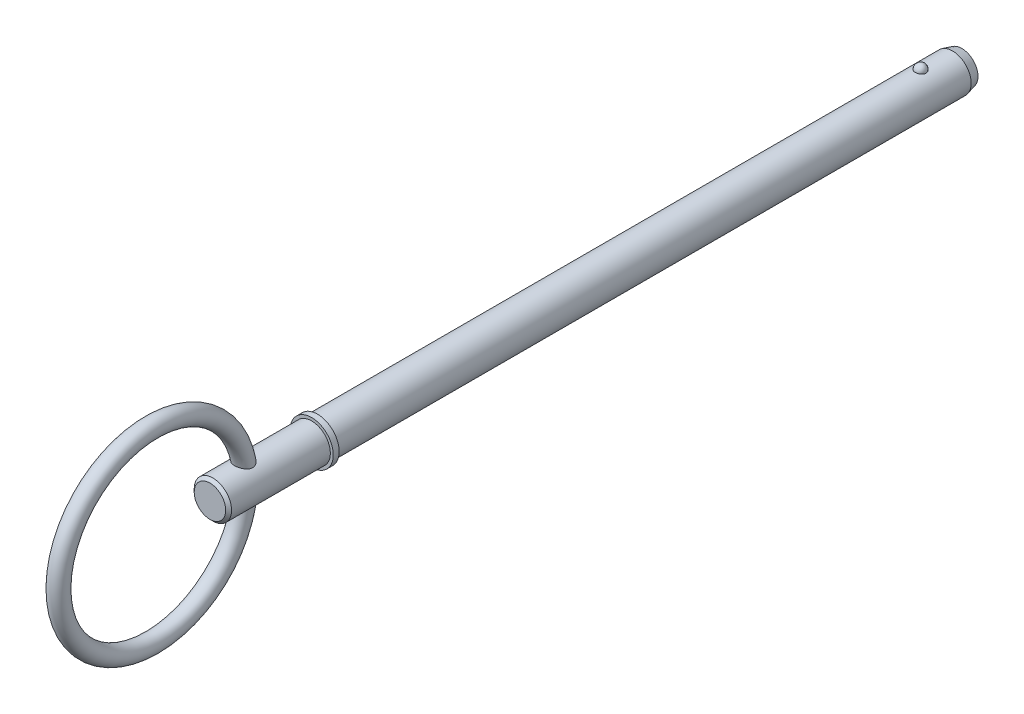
ISO-10303-21;
HEADER;
FILE_DESCRIPTION(('STEP AP214'),'2;1');
FILE_NAME('part.step','',(''),(''),'','','');
FILE_SCHEMA(('AUTOMOTIVE_DESIGN { 1 0 10303 214 1 1 1 1 }'));
ENDSEC;
DATA;
#1=APPLICATION_CONTEXT('core data for automotive mechanical design processes');
#2=APPLICATION_PROTOCOL_DEFINITION('international standard','automotive_design',2000,#1);
#3=PRODUCT_CONTEXT('',#1,'mechanical');
#4=PRODUCT('Part','Part','',(#3));
#5=PRODUCT_RELATED_PRODUCT_CATEGORY('part','',(#4));
#6=PRODUCT_DEFINITION_FORMATION('','',#4);
#7=PRODUCT_DEFINITION_CONTEXT('part definition',#1,'design');
#8=PRODUCT_DEFINITION('design','',#6,#7);
#9=PRODUCT_DEFINITION_SHAPE('','',#8);
#10=(LENGTH_UNIT() NAMED_UNIT(*) SI_UNIT(.MILLI.,.METRE.));
#11=(NAMED_UNIT(*) PLANE_ANGLE_UNIT() SI_UNIT($,.RADIAN.));
#12=(NAMED_UNIT(*) SI_UNIT($,.STERADIAN.) SOLID_ANGLE_UNIT());
#13=UNCERTAINTY_MEASURE_WITH_UNIT(LENGTH_MEASURE(1.E-05),#10,'distance_accuracy_value','');
#14=(GEOMETRIC_REPRESENTATION_CONTEXT(3) GLOBAL_UNCERTAINTY_ASSIGNED_CONTEXT((#13)) GLOBAL_UNIT_ASSIGNED_CONTEXT((#10,
#11,#12)) REPRESENTATION_CONTEXT('',''));
#15=CARTESIAN_POINT('',(0.,0.,0.));
#16=DIRECTION('',(0.,0.,1.));
#17=DIRECTION('',(1.,0.,0.));
#18=AXIS2_PLACEMENT_3D('',#15,#16,#17);
#19=CARTESIAN_POINT('',(0.,0.,101.6));
#20=DIRECTION('',(0.,0.,-1.));
#21=DIRECTION('',(-1.,0.,0.));
#22=AXIS2_PLACEMENT_3D('',#19,#20,#21);
#23=CYLINDRICAL_SURFACE('',#22,3.175);
#24=CARTESIAN_POINT('',(0.90060722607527,3.0445905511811,-0.910000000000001));
#25=CARTESIAN_POINT('',(0.90060646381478,3.04459122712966,-0.859144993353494));
#26=CARTESIAN_POINT('',(0.896466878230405,3.04582460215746,-0.808280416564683));
#27=CARTESIAN_POINT('',(0.88000740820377,3.05062019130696,-0.707994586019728));
#28=CARTESIAN_POINT('',(0.86768478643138,3.05418318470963,-0.658573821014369));
#29=CARTESIAN_POINT('',(0.835170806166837,3.06323316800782,-0.562604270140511));
#30=CARTESIAN_POINT('',(0.81498289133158,3.0687193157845,-0.516054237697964));
#31=CARTESIAN_POINT('',(0.767236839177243,3.08100268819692,-0.427093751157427));
#32=CARTESIAN_POINT('',(0.739678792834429,3.08779989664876,-0.384683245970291));
#33=CARTESIAN_POINT('',(0.677715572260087,3.10198953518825,-0.304951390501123));
#34=CARTESIAN_POINT('',(0.643275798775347,3.10938485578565,-0.267657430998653));
#35=CARTESIAN_POINT('',(0.568522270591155,3.12391647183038,-0.199446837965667));
#36=CARTESIAN_POINT('',(0.528208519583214,3.13105276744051,-0.168530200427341));
#37=CARTESIAN_POINT('',(0.442911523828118,3.14425008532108,-0.114021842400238));
#38=CARTESIAN_POINT('',(0.397942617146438,3.15031426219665,-0.0904084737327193));
#39=CARTESIAN_POINT('',(0.304493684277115,3.16071443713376,-0.0510610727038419));
#40=CARTESIAN_POINT('',(0.256014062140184,3.1650506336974,-0.0353261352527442));
#41=CARTESIAN_POINT('',(0.15789136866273,3.17144549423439,-0.012415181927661));
#42=CARTESIAN_POINT('',(0.108287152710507,3.1735453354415,-0.00508422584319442));
#43=CARTESIAN_POINT('',(0.00850701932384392,3.17538048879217,0.00133254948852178));
#44=CARTESIAN_POINT('',(-0.0416688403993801,3.17511603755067,0.000419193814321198));
#45=CARTESIAN_POINT('',(-0.140377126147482,3.17227395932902,-0.0095484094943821));
#46=CARTESIAN_POINT('',(-0.188922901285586,3.16973088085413,-0.018481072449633));
#47=CARTESIAN_POINT('',(-0.283780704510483,3.16265029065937,-0.044065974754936));
#48=CARTESIAN_POINT('',(-0.330092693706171,3.15811274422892,-0.0607183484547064));
#49=CARTESIAN_POINT('',(-0.419493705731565,3.1474895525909,-0.10140675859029));
#50=CARTESIAN_POINT('',(-0.462561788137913,3.14139480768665,-0.125486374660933));
#51=CARTESIAN_POINT('',(-0.54404237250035,3.12831396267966,-0.180346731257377));
#52=CARTESIAN_POINT('',(-0.582454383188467,3.12132776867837,-0.21112817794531));
#53=CARTESIAN_POINT('',(-0.654371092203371,3.10705591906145,-0.279257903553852));
#54=CARTESIAN_POINT('',(-0.687763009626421,3.09976707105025,-0.316724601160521));
#55=CARTESIAN_POINT('',(-0.747869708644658,3.08581767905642,-0.396782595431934));
#56=CARTESIAN_POINT('',(-0.774583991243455,3.07915718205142,-0.43937427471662));
#57=CARTESIAN_POINT('',(-0.820959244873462,3.06712152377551,-0.529074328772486));
#58=CARTESIAN_POINT('',(-0.840531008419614,3.06176288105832,-0.576231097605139));
#59=CARTESIAN_POINT('',(-0.871672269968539,3.0530437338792,-0.673291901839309));
#60=CARTESIAN_POINT('',(-0.883242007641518,3.04968316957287,-0.723195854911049));
#61=CARTESIAN_POINT('',(-0.898057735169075,3.04535343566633,-0.824104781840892));
#62=CARTESIAN_POINT('',(-0.901339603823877,3.04437395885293,-0.875104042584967));
#63=CARTESIAN_POINT('',(-0.89960137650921,3.04488803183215,-0.976947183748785));
#64=CARTESIAN_POINT('',(-0.894581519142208,3.04638151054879,-1.02779106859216));
#65=CARTESIAN_POINT('',(-0.876414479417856,3.051656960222,-1.12760218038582));
#66=CARTESIAN_POINT('',(-0.863310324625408,3.05542681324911,-1.17657789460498));
#67=CARTESIAN_POINT('',(-0.829334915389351,3.06482253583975,-1.27156757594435));
#68=CARTESIAN_POINT('',(-0.808463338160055,3.07044848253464,-1.31758141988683));
#69=CARTESIAN_POINT('',(-0.75932502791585,3.08296842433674,-1.40563218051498));
#70=CARTESIAN_POINT('',(-0.731017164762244,3.08986940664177,-1.44764515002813));
#71=CARTESIAN_POINT('',(-0.667767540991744,3.10415201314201,-1.52624913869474));
#72=CARTESIAN_POINT('',(-0.632825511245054,3.11153365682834,-1.56283993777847));
#73=CARTESIAN_POINT('',(-0.557049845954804,3.12598962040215,-1.62972906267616));
#74=CARTESIAN_POINT('',(-0.516193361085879,3.13306260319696,-1.66000181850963));
#75=CARTESIAN_POINT('',(-0.429792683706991,3.14607829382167,-1.7132172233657));
#76=CARTESIAN_POINT('',(-0.384248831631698,3.15202108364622,-1.73616040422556));
#77=CARTESIAN_POINT('',(-0.290370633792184,3.16204171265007,-1.77380927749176));
#78=CARTESIAN_POINT('',(-0.242079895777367,3.16614263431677,-1.7886174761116));
#79=CARTESIAN_POINT('',(-0.143579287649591,3.17213528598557,-1.81001390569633));
#80=CARTESIAN_POINT('',(-0.0933696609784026,3.1740272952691,-1.81660317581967));
#81=CARTESIAN_POINT('',(0.00648182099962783,3.17537830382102,-1.82132177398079));
#82=CARTESIAN_POINT('',(0.0561153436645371,3.17488455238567,-1.81961539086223));
#83=CARTESIAN_POINT('',(0.154368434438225,3.1716260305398,-1.80816900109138));
#84=CARTESIAN_POINT('',(0.202988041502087,3.16886134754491,-1.79842930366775));
#85=CARTESIAN_POINT('',(0.29764238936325,3.16137318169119,-1.77125024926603));
#86=CARTESIAN_POINT('',(0.343686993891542,3.15665785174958,-1.75384292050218));
#87=CARTESIAN_POINT('',(0.432167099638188,3.14576631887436,-1.71181408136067));
#88=CARTESIAN_POINT('',(0.474602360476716,3.13959001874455,-1.68719209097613));
#89=CARTESIAN_POINT('',(0.555408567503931,3.1263159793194,-1.63094218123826));
#90=CARTESIAN_POINT('',(0.593703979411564,3.11920512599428,-1.59920888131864));
#91=CARTESIAN_POINT('',(0.664472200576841,3.10490064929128,-1.52981493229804));
#92=CARTESIAN_POINT('',(0.696944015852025,3.09770701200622,-1.49215327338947));
#93=CARTESIAN_POINT('',(0.755798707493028,3.08388169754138,-1.41116434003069));
#94=CARTESIAN_POINT('',(0.782059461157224,3.07726269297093,-1.36774610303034));
#95=CARTESIAN_POINT('',(0.827051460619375,3.06547790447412,-1.27699966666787));
#96=CARTESIAN_POINT('',(0.845785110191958,3.06031165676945,-1.22967272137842));
#97=CARTESIAN_POINT('',(0.873798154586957,3.05242388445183,-1.13728658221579));
#98=CARTESIAN_POINT('',(0.883833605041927,3.04951005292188,-1.09247132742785));
#99=CARTESIAN_POINT('',(0.897238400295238,3.0455931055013,-1.00177329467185));
#100=CARTESIAN_POINT('',(0.900607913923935,3.0445899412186,-0.955890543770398));
#101=CARTESIAN_POINT('',(0.90060722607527,3.0445905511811,-0.910000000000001));
#102=B_SPLINE_CURVE_WITH_KNOTS('',3,(#24,#25,#26,#27,#28,#29,#30,#31,#32,#33,#34,#35,#36,#37,
#38,#39,#40,#41,#42,#43,#44,#45,#46,#47,#48,#49,#50,#51,#52,#53,#54,#55,#56,#57,#58,#59,#60,#61,
#62,#63,#64,#65,#66,#67,#68,#69,#70,#71,#72,#73,#74,#75,#76,#77,#78,#79,#80,#81,#82,#83,#84,#85,
#86,#87,#88,#89,#90,#91,#92,#93,#94,#95,#96,#97,#98,#99,#100,#101),.UNSPECIFIED.,.T.,.F.,(4,2,2,
2,2,2,2,2,2,2,2,2,2,2,2,2,2,2,2,2,2,2,2,2,2,2,2,2,2,2,2,2,2,2,2,2,2,2,4),(0.,0.152400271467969,
0.304851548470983,0.45723615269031,0.609618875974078,0.762787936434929,0.915956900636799,
1.06866739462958,1.22136034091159,1.37119044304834,1.52100555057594,1.66858689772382,
1.81617081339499,1.9646377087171,2.1131202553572,2.26455561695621,2.41600229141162,
2.5692805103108,2.72255413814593,2.87516308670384,3.02776764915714,3.1795669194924,
3.33137249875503,3.48403607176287,3.63670583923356,3.78998198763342,3.94324701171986,
4.09453370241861,4.24580126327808,4.39408543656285,4.54236390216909,4.69002878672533,
4.83770349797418,4.9877312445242,5.13778457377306,5.29058018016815,5.44332695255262,
5.58085340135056,5.71837636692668),.UNSPECIFIED.);
#103=CARTESIAN_POINT('',(0.90060722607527,3.0445905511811,-0.910000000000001));
#104=VERTEX_POINT('',#103);
#105=EDGE_CURVE('E101',#104,#104,#102,.T.);
#106=ORIENTED_EDGE('',*,*,#105,.T.);
#107=EDGE_LOOP('',(#106));
#108=FACE_BOUND('',#107,.T.);
#109=CARTESIAN_POINT('',(0.,0.,-6.33399999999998));
#110=DIRECTION('',(0.,0.,-1.));
#111=DIRECTION('',(-1.,0.,0.));
#112=AXIS2_PLACEMENT_3D('',#109,#110,#111);
#113=CIRCLE('',#112,3.175);
#114=CARTESIAN_POINT('',(-3.175,0.,-6.33399999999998));
#115=VERTEX_POINT('',#114);
#116=EDGE_CURVE('E109',#115,#115,#113,.F.);
#117=ORIENTED_EDGE('',*,*,#116,.T.);
#118=EDGE_LOOP('',(#117));
#119=FACE_BOUND('',#118,.T.);
#120=CARTESIAN_POINT('',(0.,0.,101.6));
#121=DIRECTION('',(0.,0.,1.));
#122=DIRECTION('',(1.,0.,0.));
#123=AXIS2_PLACEMENT_3D('',#120,#121,#122);
#124=CIRCLE('',#123,3.175);
#125=CARTESIAN_POINT('',(3.175,0.,101.6));
#126=VERTEX_POINT('',#125);
#127=EDGE_CURVE('E107',#126,#126,#124,.T.);
#128=ORIENTED_EDGE('',*,*,#127,.F.);
#129=EDGE_LOOP('',(#128));
#130=FACE_BOUND('',#129,.T.);
#131=ADVANCED_FACE('F39',(#108,#119,#130),#23,.T.);
#132=CARTESIAN_POINT('',(0.,0.,-7.92));
#133=DIRECTION('',(0.,0.,-1.));
#134=DIRECTION('',(-1.,0.,0.));
#135=AXIS2_PLACEMENT_3D('',#132,#133,#134);
#136=PLANE('',#135);
#137=CARTESIAN_POINT('',(0.,0.,-7.92));
#138=DIRECTION('',(0.,0.,-1.));
#139=DIRECTION('',(-1.,0.,0.));
#140=AXIS2_PLACEMENT_3D('',#137,#138,#139);
#141=CIRCLE('',#140,2.75003258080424);
#142=CARTESIAN_POINT('',(-2.75003258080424,0.,-7.92));
#143=VERTEX_POINT('',#142);
#144=EDGE_CURVE('E141',#143,#143,#141,.T.);
#145=ORIENTED_EDGE('',*,*,#144,.T.);
#146=EDGE_LOOP('',(#145));
#147=FACE_BOUND('',#146,.T.);
#148=ADVANCED_FACE('F87',(#147),#136,.T.);
#149=CARTESIAN_POINT('',(0.,0.,-7.92));
#150=DIRECTION('',(0.,0.,1.));
#151=DIRECTION('',(1.,0.,0.));
#152=AXIS2_PLACEMENT_3D('',#149,#150,#151);
#153=CONICAL_SURFACE('',#152,2.75003258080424,0.261799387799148);
#154=ORIENTED_EDGE('',*,*,#116,.F.);
#155=EDGE_LOOP('',(#154));
#156=FACE_BOUND('',#155,.T.);
#157=ORIENTED_EDGE('',*,*,#144,.F.);
#158=EDGE_LOOP('',(#157));
#159=FACE_BOUND('',#158,.T.);
#160=ADVANCED_FACE('F93',(#156,#159),#153,.T.);
#161=CARTESIAN_POINT('',(0.,3.175,-0.910000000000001));
#162=DIRECTION('',(0.,1.,0.));
#163=DIRECTION('',(0.,0.,-1.));
#164=AXIS2_PLACEMENT_3D('',#161,#162,#163);
#165=SPHERICAL_SURFACE('',#164,0.91);
#166=ORIENTED_EDGE('',*,*,#105,.F.);
#167=EDGE_LOOP('',(#166));
#168=FACE_BOUND('',#167,.T.);
#169=ADVANCED_FACE('F112',(#168),#165,.T.);
#170=CARTESIAN_POINT('',(0.,0.,101.6));
#171=DIRECTION('',(0.,0.,-1.));
#172=DIRECTION('',(-1.,0.,0.));
#173=AXIS2_PLACEMENT_3D('',#170,#171,#172);
#174=PLANE('',#173);
#175=ORIENTED_EDGE('',*,*,#127,.T.);
#176=EDGE_LOOP('',(#175));
#177=FACE_BOUND('',#176,.T.);
#178=CARTESIAN_POINT('',(0.,0.,101.6));
#179=DIRECTION('',(0.,0.,-1.));
#180=DIRECTION('',(-1.,0.,0.));
#181=AXIS2_PLACEMENT_3D('',#178,#179,#180);
#182=CIRCLE('',#181,3.675);
#183=CARTESIAN_POINT('',(-3.675,0.,101.6));
#184=VERTEX_POINT('',#183);
#185=EDGE_CURVE('E108',#184,#184,#182,.T.);
#186=ORIENTED_EDGE('',*,*,#185,.T.);
#187=EDGE_LOOP('',(#186));
#188=FACE_BOUND('',#187,.T.);
#189=ADVANCED_FACE('F116',(#177,#188),#174,.T.);
#190=CARTESIAN_POINT('',(0.,0.,33.7287874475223));
#191=DIRECTION('',(0.,0.,-1.));
#192=DIRECTION('',(-1.,0.,0.));
#193=AXIS2_PLACEMENT_3D('',#190,#191,#192);
#194=CYLINDRICAL_SURFACE('',#193,3.675);
#195=CARTESIAN_POINT('',(0.,0.,102.6));
#196=DIRECTION('',(0.,0.,-1.));
#197=DIRECTION('',(-1.,0.,0.));
#198=AXIS2_PLACEMENT_3D('',#195,#196,#197);
#199=CIRCLE('',#198,3.675);
#200=CARTESIAN_POINT('',(-3.675,0.,102.6));
#201=VERTEX_POINT('',#200);
#202=EDGE_CURVE('E133',#201,#201,#199,.T.);
#203=ORIENTED_EDGE('',*,*,#202,.T.);
#204=EDGE_LOOP('',(#203));
#205=FACE_BOUND('',#204,.T.);
#206=ORIENTED_EDGE('',*,*,#185,.F.);
#207=EDGE_LOOP('',(#206));
#208=FACE_BOUND('',#207,.T.);
#209=ADVANCED_FACE('F120',(#205,#208),#194,.T.);
#210=CARTESIAN_POINT('',(0.,3.675,102.6));
#211=DIRECTION('',(0.,0.,1.));
#212=DIRECTION('',(1.,0.,0.));
#213=AXIS2_PLACEMENT_3D('',#210,#211,#212);
#214=PLANE('',#213);
#215=CARTESIAN_POINT('',(0.,0.,102.6));
#216=DIRECTION('',(0.,0.,1.));
#217=DIRECTION('',(1.,0.,0.));
#218=AXIS2_PLACEMENT_3D('',#215,#216,#217);
#219=CIRCLE('',#218,3.175);
#220=CARTESIAN_POINT('',(3.175,0.,102.6));
#221=VERTEX_POINT('',#220);
#222=EDGE_CURVE('E111',#221,#221,#219,.T.);
#223=ORIENTED_EDGE('',*,*,#222,.F.);
#224=EDGE_LOOP('',(#223));
#225=FACE_BOUND('',#224,.T.);
#226=ORIENTED_EDGE('',*,*,#202,.F.);
#227=EDGE_LOOP('',(#226));
#228=FACE_BOUND('',#227,.T.);
#229=ADVANCED_FACE('F84',(#225,#228),#214,.T.);
#230=CARTESIAN_POINT('',(0.,0.,119.89));
#231=DIRECTION('',(0.,0.,-1.));
#232=DIRECTION('',(-1.,0.,0.));
#233=AXIS2_PLACEMENT_3D('',#230,#231,#232);
#234=CYLINDRICAL_SURFACE('',#233,3.175);
#235=CARTESIAN_POINT('',(-0.793622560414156,-3.07421343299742,112.894961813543));
#236=CARTESIAN_POINT('',(-0.723928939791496,-3.09220199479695,112.854074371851));
#237=CARTESIAN_POINT('',(-0.650537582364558,-3.10860299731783,112.818657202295));
#238=CARTESIAN_POINT('',(-0.498225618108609,-3.13662262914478,112.75960803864));
#239=CARTESIAN_POINT('',(-0.41929921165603,-3.14823615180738,112.735988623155));
#240=CARTESIAN_POINT('',(-0.258022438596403,-3.16553731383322,112.701178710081));
#241=CARTESIAN_POINT('',(-0.175668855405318,-3.17121924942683,112.690000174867));
#242=CARTESIAN_POINT('',(-0.0100583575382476,-3.17606405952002,112.680453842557));
#243=CARTESIAN_POINT('',(0.0731982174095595,-3.17522930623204,112.682081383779));
#244=CARTESIAN_POINT('',(0.236345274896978,-3.16722178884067,112.697907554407));
#245=CARTESIAN_POINT('',(0.316269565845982,-3.16018772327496,112.711831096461));
#246=CARTESIAN_POINT('',(0.472429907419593,-3.14064183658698,112.751487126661));
#247=CARTESIAN_POINT('',(0.548665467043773,-3.12812928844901,112.777221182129));
#248=CARTESIAN_POINT('',(0.696533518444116,-3.0985857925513,112.840314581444));
#249=CARTESIAN_POINT('',(0.768085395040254,-3.08149328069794,112.877833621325));
#250=CARTESIAN_POINT('',(0.90366694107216,-3.04449595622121,112.963584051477));
#251=CARTESIAN_POINT('',(0.967693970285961,-3.02459016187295,113.011819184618));
#252=CARTESIAN_POINT('',(1.08889306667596,-2.98315111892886,113.120085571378));
#253=CARTESIAN_POINT('',(1.14572430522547,-2.96158491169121,113.18048692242));
#254=CARTESIAN_POINT('',(1.24806454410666,-2.91993487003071,113.310687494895));
#255=CARTESIAN_POINT('',(1.29357550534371,-2.89985077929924,113.380485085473));
#256=CARTESIAN_POINT('',(1.37094214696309,-2.86407549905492,113.52626000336));
#257=CARTESIAN_POINT('',(1.40307792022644,-2.84829687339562,113.602066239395));
#258=CARTESIAN_POINT('',(1.45397574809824,-2.82265933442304,113.758955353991));
#259=CARTESIAN_POINT('',(1.47274938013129,-2.81279529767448,113.840033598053));
#260=CARTESIAN_POINT('',(1.49549698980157,-2.80076108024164,113.997902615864));
#261=CARTESIAN_POINT('',(1.50056337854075,-2.79802369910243,114.074495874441));
#262=CARTESIAN_POINT('',(1.49933665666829,-2.79868066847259,114.227554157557));
#263=CARTESIAN_POINT('',(1.49304097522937,-2.80207640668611,114.304019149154));
#264=CARTESIAN_POINT('',(1.46976618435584,-2.81435249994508,114.455280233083));
#265=CARTESIAN_POINT('',(1.45272287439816,-2.82326580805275,114.53006347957));
#266=CARTESIAN_POINT('',(1.40884990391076,-2.84541139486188,114.676008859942));
#267=CARTESIAN_POINT('',(1.38201642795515,-2.85864535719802,114.747169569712));
#268=CARTESIAN_POINT('',(1.31496449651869,-2.89016475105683,114.894607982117));
#269=CARTESIAN_POINT('',(1.27338339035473,-2.9089013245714,114.970169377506));
#270=CARTESIAN_POINT('',(1.17952729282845,-2.94820796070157,115.11390343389));
#271=CARTESIAN_POINT('',(1.12723913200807,-2.96878026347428,115.182066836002));
#272=CARTESIAN_POINT('',(1.00570728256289,-3.01228109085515,115.317310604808));
#273=CARTESIAN_POINT('',(0.935174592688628,-3.03519170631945,115.383249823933));
#274=CARTESIAN_POINT('',(0.782605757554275,-3.07805054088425,115.501321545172));
#275=CARTESIAN_POINT('',(0.700588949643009,-3.09800362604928,115.553476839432));
#276=CARTESIAN_POINT('',(0.549003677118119,-3.12787153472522,115.629642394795));
#277=CARTESIAN_POINT('',(0.481582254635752,-3.1390487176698,115.657437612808));
#278=CARTESIAN_POINT('',(0.342696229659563,-3.15722518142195,115.702156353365));
#279=CARTESIAN_POINT('',(0.27123564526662,-3.16422853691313,115.719090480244));
#280=CARTESIAN_POINT('',(0.125873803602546,-3.17334230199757,115.741062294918));
#281=CARTESIAN_POINT('',(0.0519637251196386,-3.17543249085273,115.746050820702));
#282=CARTESIAN_POINT('',(-0.0956207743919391,-3.17441743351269,115.743618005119));
#283=CARTESIAN_POINT('',(-0.169295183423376,-3.1713119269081,115.736196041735));
#284=CARTESIAN_POINT('',(-0.309449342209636,-3.16061694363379,115.710337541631));
#285=CARTESIAN_POINT('',(-0.376089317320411,-3.15332372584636,115.692627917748));
#286=CARTESIAN_POINT('',(-0.505583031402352,-3.13517004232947,115.647787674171));
#287=CARTESIAN_POINT('',(-0.568435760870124,-3.12430863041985,115.620654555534));
#288=CARTESIAN_POINT('',(-0.694306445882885,-3.09887452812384,115.555562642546));
#289=CARTESIAN_POINT('',(-0.756907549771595,-3.08406907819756,115.516893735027));
#290=CARTESIAN_POINT('',(-0.875645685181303,-3.05248288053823,115.431345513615));
#291=CARTESIAN_POINT('',(-0.931779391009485,-3.03570112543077,115.384462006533));
#292=CARTESIAN_POINT('',(-1.0463923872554,-2.99832170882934,115.27479262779));
#293=CARTESIAN_POINT('',(-1.10353654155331,-2.97757338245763,115.210660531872));
#294=CARTESIAN_POINT('',(-1.20755858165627,-2.93692907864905,115.074226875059));
#295=CARTESIAN_POINT('',(-1.25442453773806,-2.91703411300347,115.001915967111));
#296=CARTESIAN_POINT('',(-1.34199791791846,-2.87788786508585,114.841279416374));
#297=CARTESIAN_POINT('',(-1.38127718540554,-2.85900475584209,114.752074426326));
#298=CARTESIAN_POINT('',(-1.44406659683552,-2.82781619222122,114.567183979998));
#299=CARTESIAN_POINT('',(-1.46759319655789,-2.81550387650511,114.471505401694));
#300=CARTESIAN_POINT('',(-1.49571801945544,-2.8006591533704,114.284577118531));
#301=CARTESIAN_POINT('',(-1.50169726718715,-2.79741422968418,114.193598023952));
#302=CARTESIAN_POINT('',(-1.49747735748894,-2.79967890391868,114.012156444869));
#303=CARTESIAN_POINT('',(-1.48729863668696,-2.80517744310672,113.921693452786));
#304=CARTESIAN_POINT('',(-1.45348639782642,-2.82281521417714,113.758462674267));
#305=CARTESIAN_POINT('',(-1.43212237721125,-2.83382344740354,113.685088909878));
#306=CARTESIAN_POINT('',(-1.37828411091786,-2.86039426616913,113.543390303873));
#307=CARTESIAN_POINT('',(-1.34580440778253,-2.87595908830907,113.475067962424));
#308=CARTESIAN_POINT('',(-1.27066760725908,-2.90993532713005,113.345033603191));
#309=CARTESIAN_POINT('',(-1.22800357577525,-2.9283486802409,113.283326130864));
#310=CARTESIAN_POINT('',(-1.13363307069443,-2.96615489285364,113.167708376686));
#311=CARTESIAN_POINT('',(-1.08193541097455,-2.98554678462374,113.113790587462));
#312=CARTESIAN_POINT('',(-0.990573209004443,-3.01675653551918,113.03230940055));
#313=CARTESIAN_POINT('',(-0.953209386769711,-3.02880489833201,113.002213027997));
#314=CARTESIAN_POINT('',(-0.875544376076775,-3.0521621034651,112.945747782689));
#315=CARTESIAN_POINT('',(-0.835242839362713,-3.06347085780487,112.919379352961));
#316=CARTESIAN_POINT('',(-0.793622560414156,-3.07421343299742,112.894961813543));
#317=B_SPLINE_CURVE_WITH_KNOTS('',3,(#235,#236,#237,#238,#239,#240,#241,#242,#243,#244,#245,
#246,#247,#248,#249,#250,#251,#252,#253,#254,#255,#256,#257,#258,#259,#260,#261,#262,#263,#264,
#265,#266,#267,#268,#269,#270,#271,#272,#273,#274,#275,#276,#277,#278,#279,#280,#281,#282,#283,
#284,#285,#286,#287,#288,#289,#290,#291,#292,#293,#294,#295,#296,#297,#298,#299,#300,#301,#302,
#303,#304,#305,#306,#307,#308,#309,#310,#311,#312,#313,#314,#315,#316),.UNSPECIFIED.,.T.,.F.,(4,
2,2,2,2,2,2,2,2,2,2,2,2,2,2,2,2,2,2,2,2,2,2,2,2,2,2,2,2,2,2,2,2,2,2,2,2,2,2,2,4),(0.,
0.248167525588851,0.496599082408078,0.745269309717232,0.993849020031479,1.23700449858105,
1.48019225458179,1.72682894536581,1.97355191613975,2.22939388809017,2.48519151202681,
2.73532416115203,2.98523982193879,3.21455414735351,3.44392036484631,3.67466984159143,
3.90550934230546,4.16925064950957,4.43331832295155,4.72951976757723,5.02522832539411,
5.24564983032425,5.46585579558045,5.68696647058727,5.90808822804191,6.11521387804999,
6.32239449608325,6.54672206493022,6.77116447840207,7.03522663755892,7.29959368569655,
7.59590092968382,7.89189815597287,8.16387683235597,8.43551178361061,8.66603557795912,
8.89667271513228,9.1274673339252,9.35803801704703,9.50622339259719,9.6544263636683),.UNSPECIFIED.);
#318=CARTESIAN_POINT('',(-0.793622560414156,-3.07421343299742,112.894961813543));
#319=VERTEX_POINT('',#318);
#320=EDGE_CURVE('E10',#319,#319,#317,.T.);
#321=ORIENTED_EDGE('',*,*,#320,.F.);
#322=EDGE_LOOP('',(#321));
#323=FACE_BOUND('',#322,.T.);
#324=CARTESIAN_POINT('',(-0.793622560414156,3.07421343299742,112.894961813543));
#325=CARTESIAN_POINT('',(-0.86460683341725,3.05588589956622,112.936612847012));
#326=CARTESIAN_POINT('',(-0.931875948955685,3.03587991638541,112.98401145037));
#327=CARTESIAN_POINT('',(-1.05725170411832,2.99453227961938,113.089377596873));
#328=CARTESIAN_POINT('',(-1.11534118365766,2.97318822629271,113.147364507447));
#329=CARTESIAN_POINT('',(-1.22080462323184,2.93146441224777,113.272887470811));
#330=CARTESIAN_POINT('',(-1.26816209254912,2.91108617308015,113.340437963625));
#331=CARTESIAN_POINT('',(-1.35052787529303,2.87380473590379,113.483508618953));
#332=CARTESIAN_POINT('',(-1.38554886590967,2.85689797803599,113.559020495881));
#333=CARTESIAN_POINT('',(-1.44074287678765,2.82945202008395,113.712294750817));
#334=CARTESIAN_POINT('',(-1.46153301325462,2.81865228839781,113.789787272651));
#335=CARTESIAN_POINT('',(-1.49023441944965,2.80358650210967,113.947720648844));
#336=CARTESIAN_POINT('',(-1.49815016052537,2.79931817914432,114.028160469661));
#337=CARTESIAN_POINT('',(-1.50117056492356,2.79769676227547,114.184007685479));
#338=CARTESIAN_POINT('',(-1.49708260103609,2.79990784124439,114.25939856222));
#339=CARTESIAN_POINT('',(-1.4784698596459,2.80977909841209,114.40849830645));
#340=CARTESIAN_POINT('',(-1.46394166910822,2.8174410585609,114.482206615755));
#341=CARTESIAN_POINT('',(-1.42400377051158,2.83784609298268,114.63134437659));
#342=CARTESIAN_POINT('',(-1.39791960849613,2.85090002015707,114.706548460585));
#343=CARTESIAN_POINT('',(-1.33585690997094,2.8805017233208,114.852038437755));
#344=CARTESIAN_POINT('',(-1.29987052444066,2.89705226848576,114.922320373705));
#345=CARTESIAN_POINT('',(-1.21229019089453,2.93489412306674,115.067740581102));
#346=CARTESIAN_POINT('',(-1.15911759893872,2.95651988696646,115.141844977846));
#347=CARTESIAN_POINT('',(-1.04143166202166,2.99999612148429,115.280380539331));
#348=CARTESIAN_POINT('',(-0.976918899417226,3.0218465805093,115.344812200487));
#349=CARTESIAN_POINT('',(-0.845368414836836,3.06106710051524,115.45523022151));
#350=CARTESIAN_POINT('',(-0.77946649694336,3.0786636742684,115.502484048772));
#351=CARTESIAN_POINT('',(-0.640261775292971,3.11059085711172,115.585954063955));
#352=CARTESIAN_POINT('',(-0.566963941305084,3.12492363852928,115.622177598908));
#353=CARTESIAN_POINT('',(-0.413802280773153,3.14887886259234,115.681810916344));
#354=CARTESIAN_POINT('',(-0.333888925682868,3.15846114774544,115.705111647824));
#355=CARTESIAN_POINT('',(-0.170660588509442,3.17146222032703,115.736571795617));
#356=CARTESIAN_POINT('',(-0.0873493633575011,3.17488763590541,115.744747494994));
#357=CARTESIAN_POINT('',(0.0674621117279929,3.17509166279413,115.745231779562));
#358=CARTESIAN_POINT('',(0.138963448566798,3.17274321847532,115.739624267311));
#359=CARTESIAN_POINT('',(0.27985527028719,3.16342998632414,115.717158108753));
#360=CARTESIAN_POINT('',(0.349245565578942,3.15646478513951,115.700298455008));
#361=CARTESIAN_POINT('',(0.483013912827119,3.13875920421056,115.656711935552));
#362=CARTESIAN_POINT('',(0.54745548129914,3.12808257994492,115.6301513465));
#363=CARTESIAN_POINT('',(0.671431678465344,3.10383639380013,115.568378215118));
#364=CARTESIAN_POINT('',(0.73096479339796,3.09026594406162,115.533163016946));
#365=CARTESIAN_POINT('',(0.852308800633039,3.0591902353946,115.449871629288));
#366=CARTESIAN_POINT('',(0.91328416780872,3.04140021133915,115.400687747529));
#367=CARTESIAN_POINT('',(1.0273242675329,3.00480015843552,115.29418506));
#368=CARTESIAN_POINT('',(1.08038247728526,2.98598930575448,115.236859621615));
#369=CARTESIAN_POINT('',(1.18657794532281,2.94557646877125,115.104695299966));
#370=CARTESIAN_POINT('',(1.23812372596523,2.92405810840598,115.02854450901));
#371=CARTESIAN_POINT('',(1.32862928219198,2.88406370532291,114.86827960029));
#372=CARTESIAN_POINT('',(1.36758013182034,2.86558982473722,114.784159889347));
#373=CARTESIAN_POINT('',(1.43274280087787,2.83359383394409,114.6061421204));
#374=CARTESIAN_POINT('',(1.45837682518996,2.82030175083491,114.511986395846));
#375=CARTESIAN_POINT('',(1.49241322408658,2.80245006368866,114.319849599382));
#376=CARTESIAN_POINT('',(1.50084951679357,2.79787327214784,114.221876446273));
#377=CARTESIAN_POINT('',(1.49914798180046,2.7987793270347,114.040507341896));
#378=CARTESIAN_POINT('',(1.49154990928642,2.80288682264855,113.957078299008));
#379=CARTESIAN_POINT('',(1.46253136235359,2.81813655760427,113.79332287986));
#380=CARTESIAN_POINT('',(1.44111368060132,2.82927737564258,113.712995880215));
#381=CARTESIAN_POINT('',(1.38785163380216,2.85574398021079,113.565720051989));
#382=CARTESIAN_POINT('',(1.3572264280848,2.87055627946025,113.498230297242));
#383=CARTESIAN_POINT('',(1.28612163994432,2.90310901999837,113.369444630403));
#384=CARTESIAN_POINT('',(1.24564038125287,2.92084995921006,113.308149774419));
#385=CARTESIAN_POINT('',(1.1532082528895,2.95860856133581,113.189475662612));
#386=CARTESIAN_POINT('',(1.10072548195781,2.97869868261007,113.132534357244));
#387=CARTESIAN_POINT('',(0.987118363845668,3.01825121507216,113.027770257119));
#388=CARTESIAN_POINT('',(0.925990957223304,3.03771340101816,112.979950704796));
#389=CARTESIAN_POINT('',(0.792065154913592,3.07545294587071,112.891357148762));
#390=CARTESIAN_POINT('',(0.718757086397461,3.09356121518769,112.851278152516));
#391=CARTESIAN_POINT('',(0.565747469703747,3.12516438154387,112.783373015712));
#392=CARTESIAN_POINT('',(0.486046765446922,3.13865988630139,112.75554526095));
#393=CARTESIAN_POINT('',(0.323293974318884,3.15955163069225,112.713089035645));
#394=CARTESIAN_POINT('',(0.240283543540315,3.16700771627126,112.698330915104));
#395=CARTESIAN_POINT('',(0.0726303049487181,3.17527774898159,112.681985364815));
#396=CARTESIAN_POINT('',(-0.0120126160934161,3.17609123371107,112.680398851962));
#397=CARTESIAN_POINT('',(-0.177340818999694,3.17108555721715,112.690264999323));
#398=CARTESIAN_POINT('',(-0.258061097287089,3.16549698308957,112.701264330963));
#399=CARTESIAN_POINT('',(-0.416230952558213,3.1486007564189,112.735250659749));
#400=CARTESIAN_POINT('',(-0.493684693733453,3.13730063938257,112.758221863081));
#401=CARTESIAN_POINT('',(-0.607599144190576,3.11657538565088,112.801836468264));
#402=CARTESIAN_POINT('',(-0.64599981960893,3.10882447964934,112.818369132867));
#403=CARTESIAN_POINT('',(-0.721122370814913,3.092262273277,112.854435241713));
#404=CARTESIAN_POINT('',(-0.757844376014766,3.08345105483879,112.87396845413));
#405=CARTESIAN_POINT('',(-0.793622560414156,3.07421343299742,112.894961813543));
#406=B_SPLINE_CURVE_WITH_KNOTS('',3,(#324,#325,#326,#327,#328,#329,#330,#331,#332,#333,#334,
#335,#336,#337,#338,#339,#340,#341,#342,#343,#344,#345,#346,#347,#348,#349,#350,#351,#352,#353,
#354,#355,#356,#357,#358,#359,#360,#361,#362,#363,#364,#365,#366,#367,#368,#369,#370,#371,#372,
#373,#374,#375,#376,#377,#378,#379,#380,#381,#382,#383,#384,#385,#386,#387,#388,#389,#390,#391,
#392,#393,#394,#395,#396,#397,#398,#399,#400,#401,#402,#403,#404,#405),.UNSPECIFIED.,.T.,.F.,(4,
2,2,2,2,2,2,2,2,2,2,2,2,2,2,2,2,2,2,2,2,2,2,2,2,2,2,2,2,2,2,2,2,2,2,2,2,2,2,2,4),(0.,
0.252800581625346,0.506068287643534,0.75972256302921,1.01311541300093,1.25467278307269,
1.49614624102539,1.72175790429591,1.94744335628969,2.18851823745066,2.42978476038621,
2.7098131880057,2.98982723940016,3.23776482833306,3.48553690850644,3.73536921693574,
3.98493240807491,4.19913817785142,4.41336312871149,4.62407643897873,4.83485449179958,
5.07495869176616,5.31525962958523,5.59735778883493,5.87965543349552,6.17335015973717,
6.46646508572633,6.71664398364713,6.96677234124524,7.19253107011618,7.4183282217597,
7.6573166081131,7.89638978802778,8.15162793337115,8.40683243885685,8.65947601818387,
8.91213718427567,9.15597668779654,9.39949531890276,9.5269241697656,9.65434318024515),.UNSPECIFIED.);
#407=CARTESIAN_POINT('',(-0.793622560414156,3.07421343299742,112.894961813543));
#408=VERTEX_POINT('',#407);
#409=EDGE_CURVE('E51',#408,#408,#406,.T.);
#410=ORIENTED_EDGE('',*,*,#409,.F.);
#411=EDGE_LOOP('',(#410));
#412=FACE_BOUND('',#411,.T.);
#413=CARTESIAN_POINT('',(0.,0.,119.39));
#414=DIRECTION('',(0.,0.,-1.));
#415=DIRECTION('',(-1.,0.,0.));
#416=AXIS2_PLACEMENT_3D('',#413,#414,#415);
#417=CIRCLE('',#416,3.175);
#418=CARTESIAN_POINT('',(-3.175,0.,119.39));
#419=VERTEX_POINT('',#418);
#420=EDGE_CURVE('E63',#419,#419,#417,.T.);
#421=ORIENTED_EDGE('',*,*,#420,.T.);
#422=EDGE_LOOP('',(#421));
#423=FACE_BOUND('',#422,.T.);
#424=ORIENTED_EDGE('',*,*,#222,.T.);
#425=EDGE_LOOP('',(#424));
#426=FACE_BOUND('',#425,.T.);
#427=ADVANCED_FACE('F68',(#323,#412,#423,#426),#234,.T.);
#428=CARTESIAN_POINT('',(0.,0.,119.89));
#429=DIRECTION('',(0.,0.,-1.));
#430=DIRECTION('',(-1.,0.,0.));
#431=AXIS2_PLACEMENT_3D('',#428,#429,#430);
#432=PLANE('',#431);
#433=CARTESIAN_POINT('',(0.,0.,119.89));
#434=DIRECTION('',(0.,0.,-1.));
#435=DIRECTION('',(-1.,0.,0.));
#436=AXIS2_PLACEMENT_3D('',#433,#434,#435);
#437=CIRCLE('',#436,2.67499999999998);
#438=CARTESIAN_POINT('',(-2.67499999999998,0.,119.89));
#439=VERTEX_POINT('',#438);
#440=EDGE_CURVE('E58',#439,#439,#437,.F.);
#441=ORIENTED_EDGE('',*,*,#440,.T.);
#442=EDGE_LOOP('',(#441));
#443=FACE_BOUND('',#442,.T.);
#444=ADVANCED_FACE('F75',(#443),#432,.F.);
#445=CARTESIAN_POINT('',(0.,0.,119.39));
#446=DIRECTION('',(0.,0.,-1.));
#447=DIRECTION('',(-1.,0.,0.));
#448=AXIS2_PLACEMENT_3D('',#445,#446,#447);
#449=CONICAL_SURFACE('',#448,3.175,0.785398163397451);
#450=ORIENTED_EDGE('',*,*,#440,.F.);
#451=EDGE_LOOP('',(#450));
#452=FACE_BOUND('',#451,.T.);
#453=ORIENTED_EDGE('',*,*,#420,.F.);
#454=EDGE_LOOP('',(#453));
#455=FACE_BOUND('',#454,.T.);
#456=ADVANCED_FACE('F41',(#452,#455),#449,.T.);
#457=CARTESIAN_POINT('',(0.,0.,129.765));
#458=DIRECTION('',(1.,0.,0.));
#459=DIRECTION('',(0.,0.,-1.));
#460=AXIS2_PLACEMENT_3D('',#457,#458,#459);
#461=TOROIDAL_SURFACE('',#460,15.875,1.5);
#462=ORIENTED_EDGE('',*,*,#320,.T.);
#463=EDGE_LOOP('',(#462));
#464=FACE_BOUND('',#463,.T.);
#465=ORIENTED_EDGE('',*,*,#409,.T.);
#466=EDGE_LOOP('',(#465));
#467=FACE_BOUND('',#466,.T.);
#468=ADVANCED_FACE('F72',(#464,#467),#461,.T.);
#469=CLOSED_SHELL('',(#131,#148,#160,#169,#189,#209,#229,#427,#444,#456,#468));
#470=MANIFOLD_SOLID_BREP('B2',#469);
#471=ADVANCED_BREP_SHAPE_REPRESENTATION('',(#18,#470),#14);
#472=SHAPE_DEFINITION_REPRESENTATION(#9,#471);
ENDSEC;
END-ISO-10303-21;
